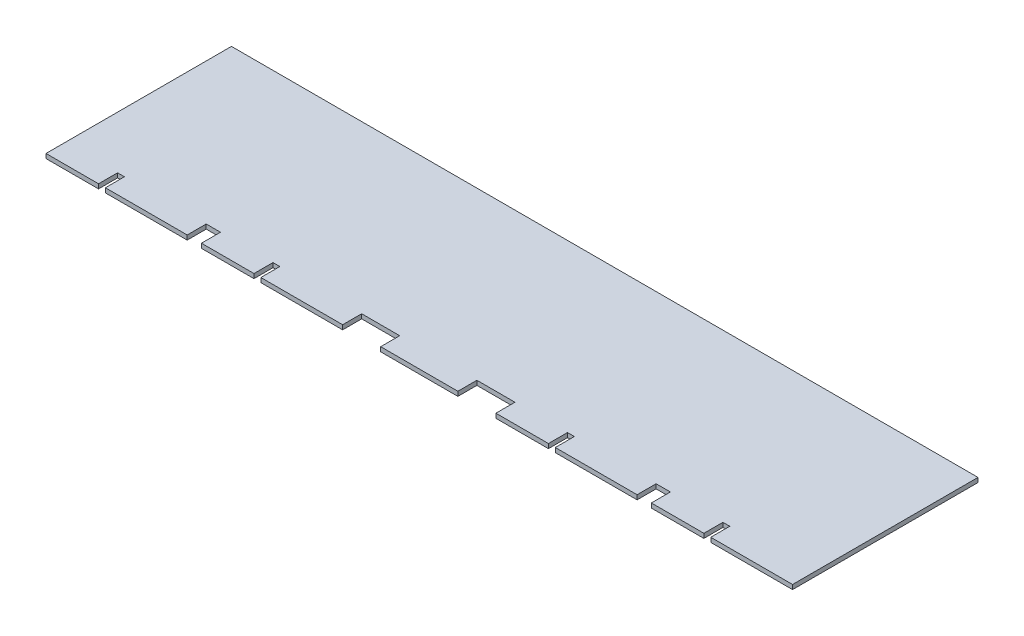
from build123d import *

# Parameters (mm, degrees)
EXTRUDE1_DEPTH = 0.775


with BuildPart() as part:
    # Sketch1 → Extrude1 (new, symmetric)
    with BuildSketch(Plane(origin=(0, 0, 0), x_dir=(1, 0, 0), z_dir=(0, 1, 0))):
        Polygon((-13.3985, 0), (0, 0), (0, 64.389), (-129.6035, 64.389), (-129.6035, 0), (-111.3663, 0), (-111.3663, 6.604), (-108.9787, 6.604), (-108.9787, 0), (-80.5815, 0), (-80.5815, 6.604), (-75.6285, 6.604), (-75.6285, 0), (-57.3913, 0), (-57.3913, 6.604), (-55.0037, 6.604), (-55.0037, 0), (-26.6065, 0), (-26.6065, 6.604), (-13.3985, 6.604), align=None)
        Polygon((0, 64.389), (0, 0), (13.3985, 0), (13.3985, 6.604), (26.6065, 6.604), (26.6065, 0), (44.8437, 0), (44.8437, 6.604), (47.2313, 6.604), (47.2313, 0), (75.6285, 0), (75.6285, 6.604), (80.5815, 6.604), (80.5815, 0), (98.8187, 0), (98.8187, 6.604), (101.2063, 6.604), (101.2063, 0), (129.6035, 0), (129.6035, 64.389), align=None)
    extrude(amount=EXTRUDE1_DEPTH, both=True)


solid = part.part
